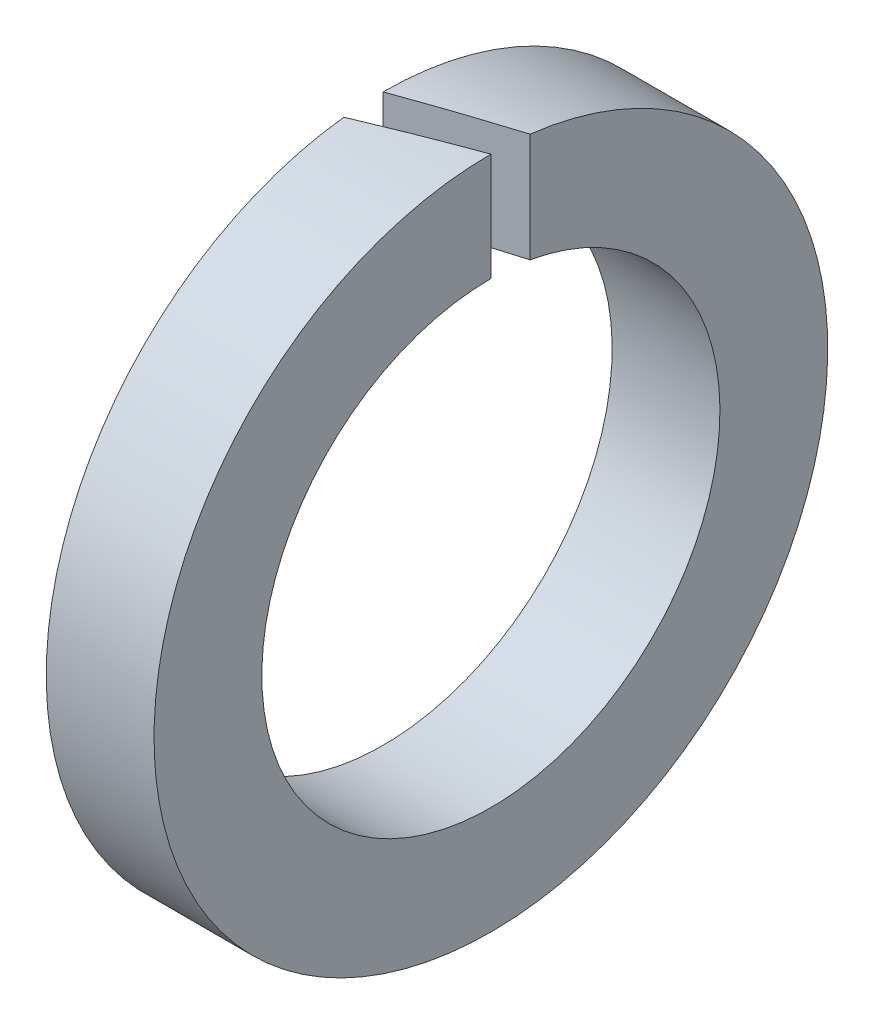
ISO-10303-21;
HEADER;
FILE_DESCRIPTION(('STEP AP214'),'2;1');
FILE_NAME('part.step','',(''),(''),'','','');
FILE_SCHEMA(('AUTOMOTIVE_DESIGN { 1 0 10303 214 1 1 1 1 }'));
ENDSEC;
DATA;
#1=APPLICATION_CONTEXT('core data for automotive mechanical design processes');
#2=APPLICATION_PROTOCOL_DEFINITION('international standard','automotive_design',2000,#1);
#3=PRODUCT_CONTEXT('',#1,'mechanical');
#4=PRODUCT('Part','Part','',(#3));
#5=PRODUCT_RELATED_PRODUCT_CATEGORY('part','',(#4));
#6=PRODUCT_DEFINITION_FORMATION('','',#4);
#7=PRODUCT_DEFINITION_CONTEXT('part definition',#1,'design');
#8=PRODUCT_DEFINITION('design','',#6,#7);
#9=PRODUCT_DEFINITION_SHAPE('','',#8);
#10=(LENGTH_UNIT() NAMED_UNIT(*) SI_UNIT(.MILLI.,.METRE.));
#11=(NAMED_UNIT(*) PLANE_ANGLE_UNIT() SI_UNIT($,.RADIAN.));
#12=(NAMED_UNIT(*) SI_UNIT($,.STERADIAN.) SOLID_ANGLE_UNIT());
#13=UNCERTAINTY_MEASURE_WITH_UNIT(LENGTH_MEASURE(1.E-05),#10,'distance_accuracy_value','');
#14=(GEOMETRIC_REPRESENTATION_CONTEXT(3) GLOBAL_UNCERTAINTY_ASSIGNED_CONTEXT((#13)) GLOBAL_UNIT_ASSIGNED_CONTEXT((#10,
#11,#12)) REPRESENTATION_CONTEXT('',''));
#15=CARTESIAN_POINT('',(0.,0.,0.));
#16=DIRECTION('',(0.,0.,1.));
#17=DIRECTION('',(1.,0.,0.));
#18=AXIS2_PLACEMENT_3D('',#15,#16,#17);
#19=CARTESIAN_POINT('',(0.,0.,-12.4999999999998));
#20=DIRECTION('',(1.,0.,0.));
#21=DIRECTION('',(0.,0.,-1.));
#22=AXIS2_PLACEMENT_3D('',#19,#20,#21);
#23=PLANE('',#22);
#24=DIRECTION('',(0.,-1.,0.));
#25=VECTOR('',#24,1.);
#26=CARTESIAN_POINT('',(0.,12.5000000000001,1.45588093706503));
#27=LINE('',#26,#25);
#28=CARTESIAN_POINT('',(0.,12.4149269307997,1.45588093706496));
#29=VERTEX_POINT('',#28);
#30=CARTESIAN_POINT('',(0.,8.37439016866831,1.45588093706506));
#31=VERTEX_POINT('',#30);
#32=EDGE_CURVE('E51',#29,#31,#27,.T.);
#33=ORIENTED_EDGE('',*,*,#32,.T.);
#34=CARTESIAN_POINT('',(0.,0.,0.));
#35=DIRECTION('',(-1.,0.,0.));
#36=DIRECTION('',(0.,0.,1.));
#37=AXIS2_PLACEMENT_3D('',#34,#35,#36);
#38=CIRCLE('',#37,8.5);
#39=CARTESIAN_POINT('',(0.,8.50000000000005,1.38777878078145E-13));
#40=VERTEX_POINT('',#39);
#41=EDGE_CURVE('E85',#40,#31,#38,.T.);
#42=ORIENTED_EDGE('',*,*,#41,.F.);
#43=DIRECTION('',(0.,-1.,0.));
#44=VECTOR('',#43,1.);
#45=CARTESIAN_POINT('',(0.,12.5000000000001,0.));
#46=LINE('',#45,#44);
#47=CARTESIAN_POINT('',(0.,12.5000000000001,0.));
#48=VERTEX_POINT('',#47);
#49=EDGE_CURVE('E94',#48,#40,#46,.T.);
#50=ORIENTED_EDGE('',*,*,#49,.F.);
#51=CARTESIAN_POINT('',(0.,0.,0.));
#52=DIRECTION('',(-1.,0.,0.));
#53=DIRECTION('',(0.,0.,1.));
#54=AXIS2_PLACEMENT_3D('',#51,#52,#53);
#55=CIRCLE('',#54,12.5);
#56=EDGE_CURVE('E83',#48,#29,#55,.T.);
#57=ORIENTED_EDGE('',*,*,#56,.T.);
#58=EDGE_LOOP('',(#33,#42,#50,#57));
#59=FACE_BOUND('',#58,.T.);
#60=ADVANCED_FACE('F30',(#59),#23,.F.);
#61=CARTESIAN_POINT('',(0.,0.,0.));
#62=DIRECTION('',(-1.,0.,0.));
#63=DIRECTION('',(0.,0.,1.));
#64=AXIS2_PLACEMENT_3D('',#61,#62,#63);
#65=CYLINDRICAL_SURFACE('',#64,8.5);
#66=CARTESIAN_POINT('',(3.99999999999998,0.,0.));
#67=DIRECTION('',(-0.342020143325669,0.,-0.939692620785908));
#68=DIRECTION('',(-0.939692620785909,0.,0.34202014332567));
#69=AXIS2_PLACEMENT_3D('',#66,#67,#68);
#70=ELLIPSE('',#69,24.8523374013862,8.5);
#71=CARTESIAN_POINT('',(3.99999999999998,8.50000000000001,1.11022302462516E-13));
#72=VERTEX_POINT('',#71);
#73=EDGE_CURVE('E87',#72,#31,#70,.F.);
#74=ORIENTED_EDGE('',*,*,#73,.F.);
#75=CARTESIAN_POINT('',(3.99999999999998,0.,0.));
#76=DIRECTION('',(-1.,0.,0.));
#77=DIRECTION('',(0.,0.,1.));
#78=AXIS2_PLACEMENT_3D('',#75,#76,#77);
#79=CIRCLE('',#78,8.5);
#80=CARTESIAN_POINT('',(3.99999999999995,8.37439016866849,-1.4558809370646));
#81=VERTEX_POINT('',#80);
#82=EDGE_CURVE('E80',#81,#72,#79,.T.);
#83=ORIENTED_EDGE('',*,*,#82,.F.);
#84=CARTESIAN_POINT('',(0.,0.,0.));
#85=DIRECTION('',(0.342020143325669,0.,0.939692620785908));
#86=DIRECTION('',(-0.939692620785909,0.,0.34202014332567));
#87=AXIS2_PLACEMENT_3D('',#84,#85,#86);
#88=ELLIPSE('',#87,24.8523374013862,8.5);
#89=EDGE_CURVE('E102',#40,#81,#88,.F.);
#90=ORIENTED_EDGE('',*,*,#89,.F.);
#91=ORIENTED_EDGE('',*,*,#41,.T.);
#92=EDGE_LOOP('',(#74,#83,#90,#91));
#93=FACE_BOUND('',#92,.T.);
#94=ADVANCED_FACE('F104',(#93),#65,.F.);
#95=CARTESIAN_POINT('',(4.,0.,-12.4999999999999));
#96=DIRECTION('',(-1.,0.,0.));
#97=DIRECTION('',(0.,0.,1.));
#98=AXIS2_PLACEMENT_3D('',#95,#96,#97);
#99=PLANE('',#98);
#100=DIRECTION('',(0.,-1.,0.));
#101=VECTOR('',#100,1.);
#102=CARTESIAN_POINT('',(3.99999999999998,12.5000000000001,0.));
#103=LINE('',#102,#101);
#104=CARTESIAN_POINT('',(3.99999999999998,12.5000000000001,0.));
#105=VERTEX_POINT('',#104);
#106=EDGE_CURVE('E68',#105,#72,#103,.T.);
#107=ORIENTED_EDGE('',*,*,#106,.F.);
#108=CARTESIAN_POINT('',(3.99999999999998,0.,0.));
#109=DIRECTION('',(-1.,0.,0.));
#110=DIRECTION('',(0.,0.,1.));
#111=AXIS2_PLACEMENT_3D('',#108,#109,#110);
#112=CIRCLE('',#111,12.5);
#113=CARTESIAN_POINT('',(4.,12.4149269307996,-1.4558809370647));
#114=VERTEX_POINT('',#113);
#115=EDGE_CURVE('E78',#114,#105,#112,.T.);
#116=ORIENTED_EDGE('',*,*,#115,.F.);
#117=DIRECTION('',(0.,-1.,0.));
#118=VECTOR('',#117,1.);
#119=CARTESIAN_POINT('',(4.00000000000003,12.4999999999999,-1.45588093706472));
#120=LINE('',#119,#118);
#121=EDGE_CURVE('E44',#114,#81,#120,.T.);
#122=ORIENTED_EDGE('',*,*,#121,.T.);
#123=ORIENTED_EDGE('',*,*,#82,.T.);
#124=EDGE_LOOP('',(#107,#116,#122,#123));
#125=FACE_BOUND('',#124,.T.);
#126=ADVANCED_FACE('F77',(#125),#99,.F.);
#127=CARTESIAN_POINT('',(0.,0.,0.));
#128=DIRECTION('',(-1.,0.,0.));
#129=DIRECTION('',(0.,0.,1.));
#130=AXIS2_PLACEMENT_3D('',#127,#128,#129);
#131=CYLINDRICAL_SURFACE('',#130,12.5);
#132=CARTESIAN_POINT('',(3.99999999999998,0.,0.));
#133=DIRECTION('',(-0.342020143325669,0.,-0.939692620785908));
#134=DIRECTION('',(-0.939692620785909,0.,0.34202014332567));
#135=AXIS2_PLACEMENT_3D('',#132,#133,#134);
#136=ELLIPSE('',#135,36.5475550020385,12.5);
#137=EDGE_CURVE('E11',#29,#105,#136,.T.);
#138=ORIENTED_EDGE('',*,*,#137,.F.);
#139=ORIENTED_EDGE('',*,*,#56,.F.);
#140=CARTESIAN_POINT('',(0.,0.,0.));
#141=DIRECTION('',(0.342020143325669,0.,0.939692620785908));
#142=DIRECTION('',(-0.939692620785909,0.,0.34202014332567));
#143=AXIS2_PLACEMENT_3D('',#140,#141,#142);
#144=ELLIPSE('',#143,36.5475550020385,12.5);
#145=EDGE_CURVE('E37',#114,#48,#144,.T.);
#146=ORIENTED_EDGE('',*,*,#145,.F.);
#147=ORIENTED_EDGE('',*,*,#115,.T.);
#148=EDGE_LOOP('',(#138,#139,#146,#147));
#149=FACE_BOUND('',#148,.T.);
#150=ADVANCED_FACE('F82',(#149),#131,.T.);
#151=CARTESIAN_POINT('',(0.,12.5000000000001,0.));
#152=DIRECTION('',(0.342020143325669,0.,0.939692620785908));
#153=DIRECTION('',(0.939692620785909,0.,-0.34202014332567));
#154=AXIS2_PLACEMENT_3D('',#151,#152,#153);
#155=PLANE('',#154);
#156=ORIENTED_EDGE('',*,*,#89,.T.);
#157=ORIENTED_EDGE('',*,*,#121,.F.);
#158=ORIENTED_EDGE('',*,*,#145,.T.);
#159=ORIENTED_EDGE('',*,*,#49,.T.);
#160=EDGE_LOOP('',(#156,#157,#158,#159));
#161=FACE_BOUND('',#160,.T.);
#162=ADVANCED_FACE('F93',(#161),#155,.T.);
#163=CARTESIAN_POINT('',(3.99999999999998,12.5000000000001,0.));
#164=DIRECTION('',(-0.342020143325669,0.,-0.939692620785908));
#165=DIRECTION('',(-0.939692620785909,0.,0.34202014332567));
#166=AXIS2_PLACEMENT_3D('',#163,#164,#165);
#167=PLANE('',#166);
#168=ORIENTED_EDGE('',*,*,#73,.T.);
#169=ORIENTED_EDGE('',*,*,#32,.F.);
#170=ORIENTED_EDGE('',*,*,#137,.T.);
#171=ORIENTED_EDGE('',*,*,#106,.T.);
#172=EDGE_LOOP('',(#168,#169,#170,#171));
#173=FACE_BOUND('',#172,.T.);
#174=ADVANCED_FACE('F67',(#173),#167,.T.);
#175=CLOSED_SHELL('',(#60,#94,#126,#150,#162,#174));
#176=MANIFOLD_SOLID_BREP('B2',#175);
#177=ADVANCED_BREP_SHAPE_REPRESENTATION('',(#18,#176),#14);
#178=SHAPE_DEFINITION_REPRESENTATION(#9,#177);
ENDSEC;
END-ISO-10303-21;
